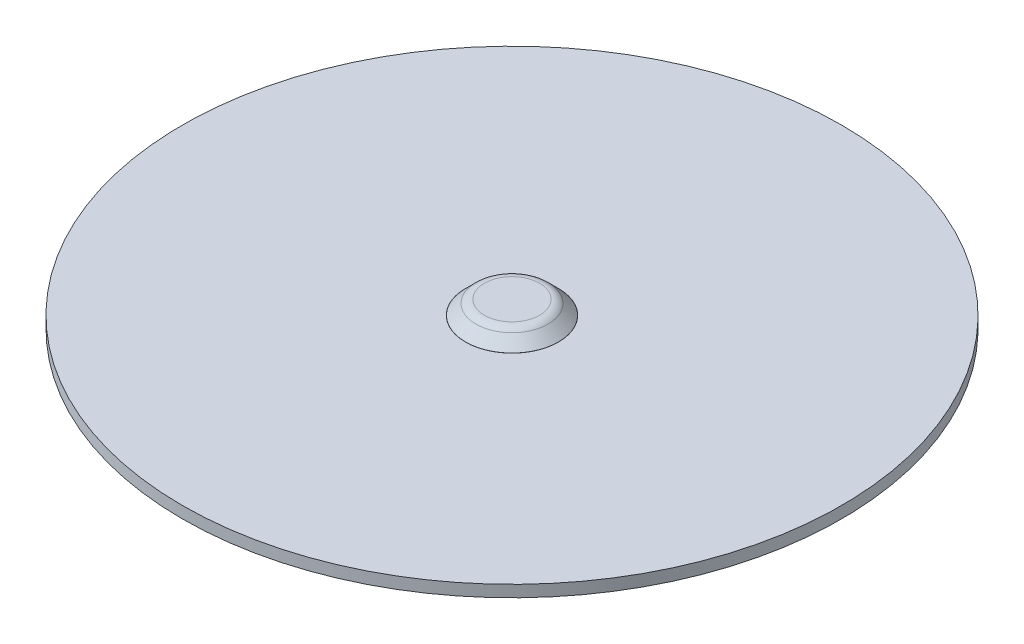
ISO-10303-21;
HEADER;
FILE_DESCRIPTION(('STEP AP214'),'2;1');
FILE_NAME('part.step','',(''),(''),'','','');
FILE_SCHEMA(('AUTOMOTIVE_DESIGN { 1 0 10303 214 1 1 1 1 }'));
ENDSEC;
DATA;
#1=APPLICATION_CONTEXT('core data for automotive mechanical design processes');
#2=APPLICATION_PROTOCOL_DEFINITION('international standard','automotive_design',2000,#1);
#3=PRODUCT_CONTEXT('',#1,'mechanical');
#4=PRODUCT('Part','Part','',(#3));
#5=PRODUCT_RELATED_PRODUCT_CATEGORY('part','',(#4));
#6=PRODUCT_DEFINITION_FORMATION('','',#4);
#7=PRODUCT_DEFINITION_CONTEXT('part definition',#1,'design');
#8=PRODUCT_DEFINITION('design','',#6,#7);
#9=PRODUCT_DEFINITION_SHAPE('','',#8);
#10=(LENGTH_UNIT() NAMED_UNIT(*) SI_UNIT(.MILLI.,.METRE.));
#11=(NAMED_UNIT(*) PLANE_ANGLE_UNIT() SI_UNIT($,.RADIAN.));
#12=(NAMED_UNIT(*) SI_UNIT($,.STERADIAN.) SOLID_ANGLE_UNIT());
#13=UNCERTAINTY_MEASURE_WITH_UNIT(LENGTH_MEASURE(1.E-05),#10,'distance_accuracy_value','');
#14=(GEOMETRIC_REPRESENTATION_CONTEXT(3) GLOBAL_UNCERTAINTY_ASSIGNED_CONTEXT((#13)) GLOBAL_UNIT_ASSIGNED_CONTEXT((#10,
#11,#12)) REPRESENTATION_CONTEXT('',''));
#15=CARTESIAN_POINT('',(0.,0.,0.));
#16=DIRECTION('',(0.,0.,1.));
#17=DIRECTION('',(1.,0.,0.));
#18=AXIS2_PLACEMENT_3D('',#15,#16,#17);
#19=CARTESIAN_POINT('',(0.,0.,0.));
#20=DIRECTION('',(0.,-1.,0.));
#21=DIRECTION('',(0.,0.,-1.));
#22=AXIS2_PLACEMENT_3D('',#19,#20,#21);
#23=PLANE('',#22);
#24=CARTESIAN_POINT('',(0.,0.,0.));
#25=DIRECTION('',(0.,-1.,0.));
#26=DIRECTION('',(0.,0.,1.));
#27=AXIS2_PLACEMENT_3D('',#24,#25,#26);
#28=CIRCLE('',#27,3.556);
#29=CARTESIAN_POINT('',(0.,0.,3.556));
#30=VERTEX_POINT('',#29);
#31=CARTESIAN_POINT('',(0.,0.,-3.556));
#32=VERTEX_POINT('',#31);
#33=EDGE_CURVE('E55',#30,#32,#28,.T.);
#34=ORIENTED_EDGE('',*,*,#33,.F.);
#35=CARTESIAN_POINT('',(0.,0.,0.));
#36=DIRECTION('',(0.,-1.,0.));
#37=DIRECTION('',(0.,0.,-1.));
#38=AXIS2_PLACEMENT_3D('',#35,#36,#37);
#39=CIRCLE('',#38,3.556);
#40=EDGE_CURVE('E57',#32,#30,#39,.T.);
#41=ORIENTED_EDGE('',*,*,#40,.F.);
#42=EDGE_LOOP('',(#34,#41));
#43=FACE_BOUND('',#42,.T.);
#44=ADVANCED_FACE('F18',(#43),#23,.F.);
#45=CARTESIAN_POINT('',(0.,-1.524,0.));
#46=DIRECTION('',(0.,1.,0.));
#47=DIRECTION('',(0.,0.,1.));
#48=AXIS2_PLACEMENT_3D('',#45,#46,#47);
#49=TOROIDAL_SURFACE('',#48,3.556,1.524);
#50=ORIENTED_EDGE('',*,*,#33,.T.);
#51=ORIENTED_EDGE('',*,*,#40,.T.);
#52=EDGE_LOOP('',(#50,#51));
#53=FACE_BOUND('',#52,.T.);
#54=CARTESIAN_POINT('',(0.,-0.446369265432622,0.));
#55=DIRECTION('',(0.,-1.,0.));
#56=DIRECTION('',(0.,0.,-1.));
#57=AXIS2_PLACEMENT_3D('',#54,#55,#56);
#58=CIRCLE('',#57,4.63363073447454);
#59=CARTESIAN_POINT('',(0.,-0.446369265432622,-4.63363073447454));
#60=VERTEX_POINT('',#59);
#61=EDGE_CURVE('E63',#60,#60,#58,.T.);
#62=ORIENTED_EDGE('',*,*,#61,.F.);
#63=EDGE_LOOP('',(#62));
#64=FACE_BOUND('',#63,.T.);
#65=ADVANCED_FACE('F59',(#53,#64),#49,.T.);
#66=CARTESIAN_POINT('',(0.,-1.77056051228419,0.));
#67=DIRECTION('',(0.,-1.,0.));
#68=DIRECTION('',(0.,0.,-1.));
#69=AXIS2_PLACEMENT_3D('',#66,#67,#68);
#70=CONICAL_SURFACE('',#69,5.95782198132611,0.785398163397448);
#71=CARTESIAN_POINT('',(0.,-1.77056051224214,0.));
#72=DIRECTION('',(0.,1.,0.));
#73=DIRECTION('',(0.,0.,1.));
#74=AXIS2_PLACEMENT_3D('',#71,#72,#73);
#75=CIRCLE('',#74,5.95782198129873);
#76=CARTESIAN_POINT('',(0.,-1.77056051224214,5.95782198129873));
#77=VERTEX_POINT('',#76);
#78=EDGE_CURVE('E221',#77,#77,#75,.T.);
#79=ORIENTED_EDGE('',*,*,#78,.T.);
#80=EDGE_LOOP('',(#79));
#81=FACE_BOUND('',#80,.T.);
#82=ORIENTED_EDGE('',*,*,#61,.T.);
#83=EDGE_LOOP('',(#82));
#84=FACE_BOUND('',#83,.T.);
#85=ADVANCED_FACE('F89',(#81,#84),#70,.T.);
#86=CARTESIAN_POINT('',(0.,-1.4986,0.));
#87=DIRECTION('',(0.,1.,0.));
#88=DIRECTION('',(0.,0.,1.));
#89=AXIS2_PLACEMENT_3D('',#86,#87,#88);
#90=PLANE('',#89);
#91=CARTESIAN_POINT('',(0.,-1.4986,0.));
#92=DIRECTION('',(0.,1.,0.));
#93=DIRECTION('',(0.,0.,-1.));
#94=AXIS2_PLACEMENT_3D('',#91,#92,#93);
#95=CIRCLE('',#94,3.556);
#96=CARTESIAN_POINT('',(0.,-1.4986,3.556));
#97=VERTEX_POINT('',#96);
#98=CARTESIAN_POINT('',(0.,-1.4986,-3.556));
#99=VERTEX_POINT('',#98);
#100=EDGE_CURVE('E217',#97,#99,#95,.F.);
#101=ORIENTED_EDGE('',*,*,#100,.T.);
#102=CARTESIAN_POINT('',(0.,-1.4986,0.));
#103=DIRECTION('',(0.,1.,0.));
#104=DIRECTION('',(0.,0.,1.));
#105=AXIS2_PLACEMENT_3D('',#102,#103,#104);
#106=CIRCLE('',#105,3.556);
#107=EDGE_CURVE('E215',#99,#97,#106,.F.);
#108=ORIENTED_EDGE('',*,*,#107,.T.);
#109=EDGE_LOOP('',(#101,#108));
#110=FACE_BOUND('',#109,.T.);
#111=ADVANCED_FACE('F191',(#110),#90,.F.);
#112=CARTESIAN_POINT('',(0.,-1.7526,0.));
#113=DIRECTION('',(0.,1.,0.));
#114=DIRECTION('',(0.,0.,1.));
#115=AXIS2_PLACEMENT_3D('',#112,#113,#114);
#116=TOROIDAL_SURFACE('',#115,5.97578249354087,0.0253999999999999);
#117=ORIENTED_EDGE('',*,*,#78,.F.);
#118=EDGE_LOOP('',(#117));
#119=FACE_BOUND('',#118,.T.);
#120=CARTESIAN_POINT('',(0.,-1.778,0.));
#121=DIRECTION('',(0.,1.,0.));
#122=DIRECTION('',(0.,0.,-1.));
#123=AXIS2_PLACEMENT_3D('',#120,#121,#122);
#124=CIRCLE('',#123,5.97578249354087);
#125=CARTESIAN_POINT('',(0.,-1.778,-5.97578249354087));
#126=VERTEX_POINT('',#125);
#127=CARTESIAN_POINT('',(0.,-1.778,5.97578249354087));
#128=VERTEX_POINT('',#127);
#129=EDGE_CURVE('E150',#126,#128,#124,.T.);
#130=ORIENTED_EDGE('',*,*,#129,.T.);
#131=CARTESIAN_POINT('',(0.,-1.778,0.));
#132=DIRECTION('',(0.,1.,0.));
#133=DIRECTION('',(0.,0.,1.));
#134=AXIS2_PLACEMENT_3D('',#131,#132,#133);
#135=CIRCLE('',#134,5.97578249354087);
#136=EDGE_CURVE('E182',#128,#126,#135,.T.);
#137=ORIENTED_EDGE('',*,*,#136,.T.);
#138=EDGE_LOOP('',(#130,#137));
#139=FACE_BOUND('',#138,.T.);
#140=ADVANCED_FACE('F188',(#119,#139),#116,.F.);
#141=CARTESIAN_POINT('',(0.,-1.524,0.));
#142=DIRECTION('',(0.,1.,0.));
#143=DIRECTION('',(0.,0.,1.));
#144=AXIS2_PLACEMENT_3D('',#141,#142,#143);
#145=TOROIDAL_SURFACE('',#144,3.556,0.0254000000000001);
#146=CARTESIAN_POINT('',(0.,-1.50603948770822,0.));
#147=DIRECTION('',(0.,-1.,0.));
#148=DIRECTION('',(0.,0.,-1.));
#149=AXIS2_PLACEMENT_3D('',#146,#147,#148);
#150=CIRCLE('',#149,3.57396051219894);
#151=CARTESIAN_POINT('',(0.,-1.50603948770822,-3.57396051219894));
#152=VERTEX_POINT('',#151);
#153=EDGE_CURVE('E107',#152,#152,#150,.T.);
#154=ORIENTED_EDGE('',*,*,#153,.T.);
#155=EDGE_LOOP('',(#154));
#156=FACE_BOUND('',#155,.T.);
#157=ORIENTED_EDGE('',*,*,#100,.F.);
#158=ORIENTED_EDGE('',*,*,#107,.F.);
#159=EDGE_LOOP('',(#157,#158));
#160=FACE_BOUND('',#159,.T.);
#161=ADVANCED_FACE('F167',(#156,#160),#145,.F.);
#162=CARTESIAN_POINT('',(5.97578249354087,-1.778,0.));
#163=DIRECTION('',(0.,-1.,0.));
#164=DIRECTION('',(0.,0.,-1.));
#165=AXIS2_PLACEMENT_3D('',#162,#163,#164);
#166=PLANE('',#165);
#167=CARTESIAN_POINT('',(0.,-1.778,0.));
#168=DIRECTION('',(0.,1.,0.));
#169=DIRECTION('',(0.,0.,1.));
#170=AXIS2_PLACEMENT_3D('',#167,#168,#169);
#171=CIRCLE('',#170,42.3477777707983);
#172=CARTESIAN_POINT('',(0.,-1.778,42.3477777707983));
#173=VERTEX_POINT('',#172);
#174=EDGE_CURVE('E104',#173,#173,#171,.F.);
#175=ORIENTED_EDGE('',*,*,#174,.F.);
#176=EDGE_LOOP('',(#175));
#177=FACE_BOUND('',#176,.T.);
#178=ORIENTED_EDGE('',*,*,#129,.F.);
#179=ORIENTED_EDGE('',*,*,#136,.F.);
#180=EDGE_LOOP('',(#178,#179));
#181=FACE_BOUND('',#180,.T.);
#182=ADVANCED_FACE('F157',(#177,#181),#166,.F.);
#183=CARTESIAN_POINT('',(0.,-2.83023073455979,0.));
#184=DIRECTION('',(0.,-1.,0.));
#185=DIRECTION('',(0.,0.,-1.));
#186=AXIS2_PLACEMENT_3D('',#183,#184,#185);
#187=CONICAL_SURFACE('',#186,4.89815175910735,0.785398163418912);
#188=ORIENTED_EDGE('',*,*,#153,.F.);
#189=EDGE_LOOP('',(#188));
#190=FACE_BOUND('',#189,.T.);
#191=CARTESIAN_POINT('',(0.,-2.8302307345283,0.));
#192=DIRECTION('',(0.,1.,0.));
#193=DIRECTION('',(0.,0.,1.));
#194=AXIS2_PLACEMENT_3D('',#191,#192,#193);
#195=CIRCLE('',#194,4.89815175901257);
#196=CARTESIAN_POINT('',(0.,-2.8302307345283,4.89815175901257));
#197=VERTEX_POINT('',#196);
#198=EDGE_CURVE('E103',#197,#197,#195,.T.);
#199=ORIENTED_EDGE('',*,*,#198,.F.);
#200=EDGE_LOOP('',(#199));
#201=FACE_BOUND('',#200,.T.);
#202=ADVANCED_FACE('F166',(#190,#201),#187,.F.);
#203=CARTESIAN_POINT('',(0.,0.,0.));
#204=DIRECTION('',(0.,1.,0.));
#205=DIRECTION('',(0.,0.,1.));
#206=AXIS2_PLACEMENT_3D('',#203,#204,#205);
#207=CYLINDRICAL_SURFACE('',#206,42.3477777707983);
#208=ORIENTED_EDGE('',*,*,#174,.T.);
#209=EDGE_LOOP('',(#208));
#210=FACE_BOUND('',#209,.T.);
#211=CARTESIAN_POINT('',(0.,-3.2766,0.));
#212=DIRECTION('',(0.,1.,0.));
#213=DIRECTION('',(0.,0.,1.));
#214=AXIS2_PLACEMENT_3D('',#211,#212,#213);
#215=CIRCLE('',#214,42.3477777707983);
#216=CARTESIAN_POINT('',(0.,-3.2766,42.3477777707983));
#217=VERTEX_POINT('',#216);
#218=EDGE_CURVE('E95',#217,#217,#215,.T.);
#219=ORIENTED_EDGE('',*,*,#218,.T.);
#220=EDGE_LOOP('',(#219));
#221=FACE_BOUND('',#220,.T.);
#222=ADVANCED_FACE('F127',(#210,#221),#207,.T.);
#223=CARTESIAN_POINT('',(0.,-1.7526,0.));
#224=DIRECTION('',(0.,1.,0.));
#225=DIRECTION('',(0.,0.,1.));
#226=AXIS2_PLACEMENT_3D('',#223,#224,#225);
#227=TOROIDAL_SURFACE('',#226,5.97578249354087,1.524);
#228=CARTESIAN_POINT('',(0.,-3.2766,0.));
#229=DIRECTION('',(0.,-1.,0.));
#230=DIRECTION('',(0.,0.,1.));
#231=AXIS2_PLACEMENT_3D('',#228,#229,#230);
#232=CIRCLE('',#231,5.97578249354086);
#233=CARTESIAN_POINT('',(0.,-3.2766,5.97578249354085));
#234=VERTEX_POINT('',#233);
#235=CARTESIAN_POINT('',(0.,-3.2766,-5.97578249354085));
#236=VERTEX_POINT('',#235);
#237=EDGE_CURVE('E29',#234,#236,#232,.T.);
#238=ORIENTED_EDGE('',*,*,#237,.T.);
#239=CARTESIAN_POINT('',(0.,-3.2766,0.));
#240=DIRECTION('',(0.,-1.,0.));
#241=DIRECTION('',(0.,0.,-1.));
#242=AXIS2_PLACEMENT_3D('',#239,#240,#241);
#243=CIRCLE('',#242,5.97578249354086);
#244=EDGE_CURVE('E11',#236,#234,#243,.T.);
#245=ORIENTED_EDGE('',*,*,#244,.T.);
#246=EDGE_LOOP('',(#238,#245));
#247=FACE_BOUND('',#246,.T.);
#248=ORIENTED_EDGE('',*,*,#198,.T.);
#249=EDGE_LOOP('',(#248));
#250=FACE_BOUND('',#249,.T.);
#251=ADVANCED_FACE('F115',(#247,#250),#227,.T.);
#252=CARTESIAN_POINT('',(5.97578249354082,-3.2766,0.));
#253=DIRECTION('',(0.,1.,0.));
#254=DIRECTION('',(0.,0.,1.));
#255=AXIS2_PLACEMENT_3D('',#252,#253,#254);
#256=PLANE('',#255);
#257=ORIENTED_EDGE('',*,*,#237,.F.);
#258=ORIENTED_EDGE('',*,*,#244,.F.);
#259=EDGE_LOOP('',(#257,#258));
#260=FACE_BOUND('',#259,.T.);
#261=ORIENTED_EDGE('',*,*,#218,.F.);
#262=EDGE_LOOP('',(#261));
#263=FACE_BOUND('',#262,.T.);
#264=ADVANCED_FACE('F126',(#260,#263),#256,.F.);
#265=CLOSED_SHELL('',(#44,#65,#85,#111,#140,#161,#182,#202,#222,#251,#264));
#266=MANIFOLD_SOLID_BREP('B1',#265);
#267=ADVANCED_BREP_SHAPE_REPRESENTATION('',(#18,#266),#14);
#268=SHAPE_DEFINITION_REPRESENTATION(#9,#267);
ENDSEC;
END-ISO-10303-21;
